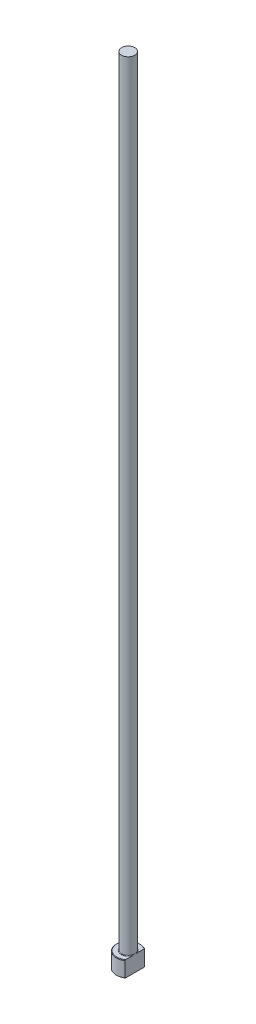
from build123d import *
from build123d.topology import SkipClean

# Parameters (mm, degrees)
CHAMFER1_SIZE    = 0.2
FILLET1_R        = 0.2
KEYED_HEAD_DEPTH = 301.067492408


with BuildPart() as part:
    # Sketch1 → Revolve1 (revolve)
    with BuildSketch(Plane.XY, mode=Mode.PRIVATE) as revolve1_sk:
        Polygon((0, 0), (-4.5, 0), (-4.5, 6), (-2.5, 6), (-2.5, 300), (0, 300), align=None)
    revolve(revolve1_sk.sketch.rotate(Axis((0, 259.958771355, 0), (0, -1, 0)), 270), axis=Axis((0, 259.958771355, 0), (0, -1, 0)))

    # Chamfer1
    chamfer1_edges = [part.edges().sort_by_distance(p)[0] for p in [
        (0, 6, -4.5),
        (0, 0, -4.5),
    ]]
    chamfer(chamfer1_edges, length=CHAMFER1_SIZE)

    # Fillet1
    fillet1_edges = [part.edges().sort_by_distance(p)[0] for p in [
        (0, 6, -2.5),
    ]]
    fillet(fillet1_edges, radius=FILLET1_R)

    # Sketch2 → KEYED HEAD (cut, through all)
    with SkipClean():  # the faces are left unmerged after this step: merging them gives an invalid solid
        with BuildSketch(Plane(origin=(0, 0, 0), x_dir=(1, 0, 0), z_dir=(0, 1, 0))):
            with BuildLine():
                Line((2.5, -3.741657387), (2.5, 3.741657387))
                ThreePointArc((2.5, 3.741657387), (4.5, 0), (2.5, -3.741657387))
            make_face()
        extrude(amount=KEYED_HEAD_DEPTH, mode=Mode.SUBTRACT)


solid = part.part
